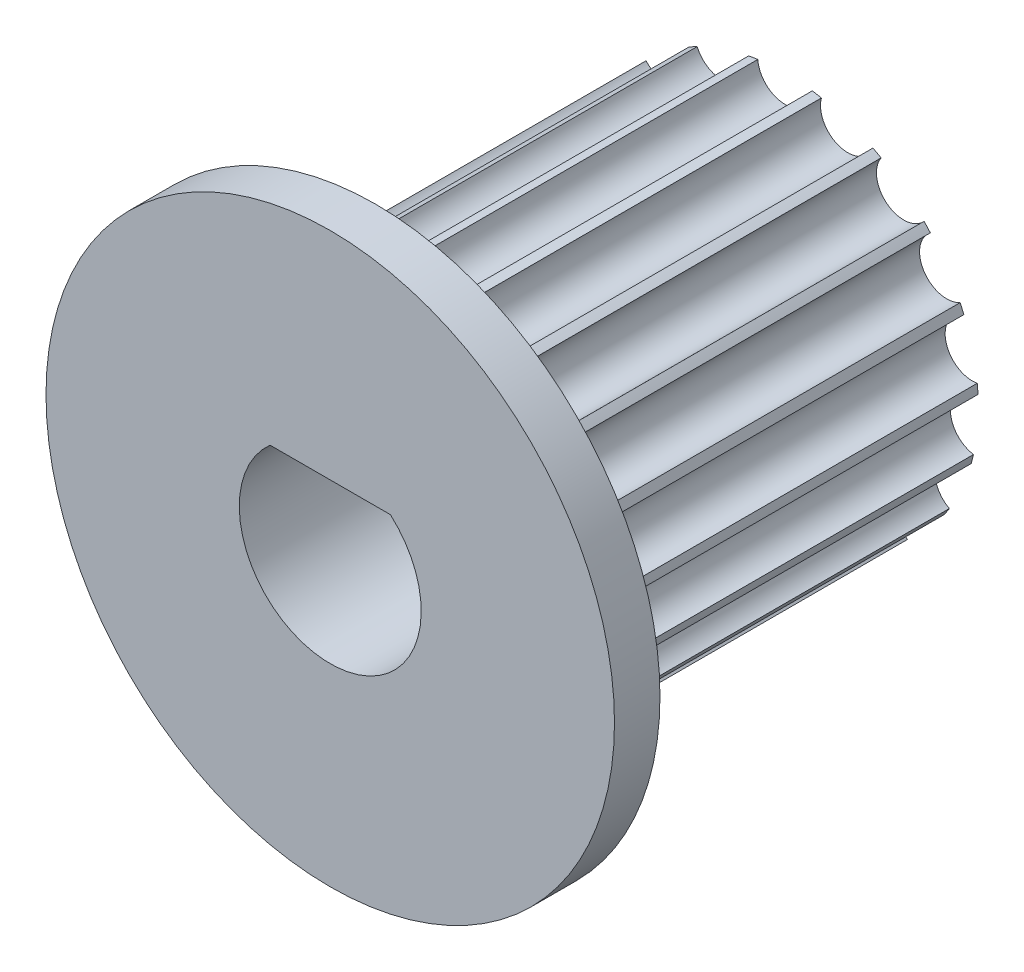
ISO-10303-21;
HEADER;
FILE_DESCRIPTION(('STEP AP214'),'2;1');
FILE_NAME('part.step','',(''),(''),'','','');
FILE_SCHEMA(('AUTOMOTIVE_DESIGN { 1 0 10303 214 1 1 1 1 }'));
ENDSEC;
DATA;
#1=APPLICATION_CONTEXT('core data for automotive mechanical design processes');
#2=APPLICATION_PROTOCOL_DEFINITION('international standard','automotive_design',2000,#1);
#3=PRODUCT_CONTEXT('',#1,'mechanical');
#4=PRODUCT('Part','Part','',(#3));
#5=PRODUCT_RELATED_PRODUCT_CATEGORY('part','',(#4));
#6=PRODUCT_DEFINITION_FORMATION('','',#4);
#7=PRODUCT_DEFINITION_CONTEXT('part definition',#1,'design');
#8=PRODUCT_DEFINITION('design','',#6,#7);
#9=PRODUCT_DEFINITION_SHAPE('','',#8);
#10=(LENGTH_UNIT() NAMED_UNIT(*) SI_UNIT(.MILLI.,.METRE.));
#11=(NAMED_UNIT(*) PLANE_ANGLE_UNIT() SI_UNIT($,.RADIAN.));
#12=(NAMED_UNIT(*) SI_UNIT($,.STERADIAN.) SOLID_ANGLE_UNIT());
#13=UNCERTAINTY_MEASURE_WITH_UNIT(LENGTH_MEASURE(1.E-05),#10,'distance_accuracy_value','');
#14=(GEOMETRIC_REPRESENTATION_CONTEXT(3) GLOBAL_UNCERTAINTY_ASSIGNED_CONTEXT((#13)) GLOBAL_UNIT_ASSIGNED_CONTEXT((#10,
#11,#12)) REPRESENTATION_CONTEXT('',''));
#15=CARTESIAN_POINT('',(0.,0.,0.));
#16=DIRECTION('',(0.,0.,1.));
#17=DIRECTION('',(1.,0.,0.));
#18=AXIS2_PLACEMENT_3D('',#15,#16,#17);
#19=CARTESIAN_POINT('',(0.,0.,0.));
#20=DIRECTION('',(0.,0.,-1.));
#21=DIRECTION('',(-1.,0.,0.));
#22=AXIS2_PLACEMENT_3D('',#19,#20,#21);
#23=PLANE('',#22);
#24=DIRECTION('',(1.,0.,0.));
#25=VECTOR('',#24,1.);
#26=CARTESIAN_POINT('',(2.64575131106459,3.,0.));
#27=LINE('',#26,#25);
#28=CARTESIAN_POINT('',(-2.64575131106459,3.,0.));
#29=VERTEX_POINT('',#28);
#30=CARTESIAN_POINT('',(2.64575131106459,3.,0.));
#31=VERTEX_POINT('',#30);
#32=EDGE_CURVE('E522',#29,#31,#27,.T.);
#33=ORIENTED_EDGE('',*,*,#32,.T.);
#34=CARTESIAN_POINT('',(0.,0.,0.));
#35=DIRECTION('',(0.,0.,-1.));
#36=DIRECTION('',(-1.,0.,0.));
#37=AXIS2_PLACEMENT_3D('',#34,#35,#36);
#38=CIRCLE('',#37,4.);
#39=EDGE_CURVE('E524',#31,#29,#38,.T.);
#40=ORIENTED_EDGE('',*,*,#39,.T.);
#41=EDGE_LOOP('',(#33,#40));
#42=FACE_BOUND('',#41,.T.);
#43=CARTESIAN_POINT('',(0.,0.,0.));
#44=DIRECTION('',(0.,0.,1.));
#45=DIRECTION('',(1.,0.,0.));
#46=AXIS2_PLACEMENT_3D('',#43,#44,#45);
#47=CIRCLE('',#46,12.5);
#48=CARTESIAN_POINT('',(12.5,0.,0.));
#49=VERTEX_POINT('',#48);
#50=EDGE_CURVE('E490',#49,#49,#47,.T.);
#51=ORIENTED_EDGE('',*,*,#50,.T.);
#52=EDGE_LOOP('',(#51));
#53=FACE_BOUND('',#52,.T.);
#54=ADVANCED_FACE('F31',(#42,#53),#23,.F.);
#55=CARTESIAN_POINT('',(0.,0.,28.6646892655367));
#56=DIRECTION('',(0.,0.,1.));
#57=DIRECTION('',(1.,0.,0.));
#58=AXIS2_PLACEMENT_3D('',#55,#56,#57);
#59=CYLINDRICAL_SURFACE('',#58,12.5);
#60=ORIENTED_EDGE('',*,*,#50,.F.);
#61=EDGE_LOOP('',(#60));
#62=FACE_BOUND('',#61,.T.);
#63=CARTESIAN_POINT('',(0.,0.,-2.));
#64=DIRECTION('',(0.,0.,1.));
#65=DIRECTION('',(1.,0.,0.));
#66=AXIS2_PLACEMENT_3D('',#63,#64,#65);
#67=CIRCLE('',#66,12.5);
#68=CARTESIAN_POINT('',(12.5,0.,-2.));
#69=VERTEX_POINT('',#68);
#70=EDGE_CURVE('E321',#69,#69,#67,.T.);
#71=ORIENTED_EDGE('',*,*,#70,.T.);
#72=EDGE_LOOP('',(#71));
#73=FACE_BOUND('',#72,.T.);
#74=ADVANCED_FACE('F496',(#62,#73),#59,.T.);
#75=CARTESIAN_POINT('',(0.,12.5,-2.));
#76=DIRECTION('',(0.,0.,1.));
#77=DIRECTION('',(1.,0.,0.));
#78=AXIS2_PLACEMENT_3D('',#75,#76,#77);
#79=PLANE('',#78);
#80=ORIENTED_EDGE('',*,*,#70,.F.);
#81=EDGE_LOOP('',(#80));
#82=FACE_BOUND('',#81,.T.);
#83=CARTESIAN_POINT('',(0.,0.,-2.));
#84=DIRECTION('',(0.,0.,1.));
#85=DIRECTION('',(1.,0.,0.));
#86=AXIS2_PLACEMENT_3D('',#83,#84,#85);
#87=CIRCLE('',#86,8.5);
#88=CARTESIAN_POINT('',(8.5,0.,-2.));
#89=VERTEX_POINT('',#88);
#90=EDGE_CURVE('E316',#89,#89,#87,.T.);
#91=ORIENTED_EDGE('',*,*,#90,.T.);
#92=EDGE_LOOP('',(#91));
#93=FACE_BOUND('',#92,.T.);
#94=ADVANCED_FACE('F498',(#82,#93),#79,.F.);
#95=CARTESIAN_POINT('',(0.,0.,28.6646892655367));
#96=DIRECTION('',(0.,0.,1.));
#97=DIRECTION('',(1.,0.,0.));
#98=AXIS2_PLACEMENT_3D('',#95,#96,#97);
#99=CYLINDRICAL_SURFACE('',#98,8.5);
#100=ORIENTED_EDGE('',*,*,#90,.F.);
#101=EDGE_LOOP('',(#100));
#102=FACE_BOUND('',#101,.T.);
#103=CARTESIAN_POINT('',(0.,0.,-3.));
#104=DIRECTION('',(0.,0.,-1.));
#105=DIRECTION('',(-1.,0.,0.));
#106=AXIS2_PLACEMENT_3D('',#103,#104,#105);
#107=CIRCLE('',#106,8.5);
#108=CARTESIAN_POINT('',(1.60029200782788,8.34799769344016,-3.));
#109=VERTEX_POINT('',#108);
#110=CARTESIAN_POINT('',(3.86459105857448,7.57066284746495,-3.));
#111=VERTEX_POINT('',#110);
#112=EDGE_CURVE('E11',#109,#111,#107,.T.);
#113=ORIENTED_EDGE('',*,*,#112,.F.);
#114=DIRECTION('',(0.,0.,-1.));
#115=VECTOR('',#114,1.);
#116=CARTESIAN_POINT('',(1.60029200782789,8.34799769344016,-11.5));
#117=LINE('',#116,#115);
#118=CARTESIAN_POINT('',(1.60029200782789,8.34799769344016,-20.));
#119=VERTEX_POINT('',#118);
#120=EDGE_CURVE('E287',#109,#119,#117,.T.);
#121=ORIENTED_EDGE('',*,*,#120,.T.);
#122=CARTESIAN_POINT('',(0.,0.,-20.));
#123=DIRECTION('',(0.,0.,1.));
#124=DIRECTION('',(1.,0.,0.));
#125=AXIS2_PLACEMENT_3D('',#122,#123,#124);
#126=CIRCLE('',#125,8.5);
#127=CARTESIAN_POINT('',(1.19700664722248,8.41529411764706,-20.));
#128=VERTEX_POINT('',#127);
#129=EDGE_CURVE('E298',#119,#128,#126,.T.);
#130=ORIENTED_EDGE('',*,*,#129,.T.);
#131=DIRECTION('',(0.,0.,-1.));
#132=VECTOR('',#131,1.);
#133=CARTESIAN_POINT('',(1.19700664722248,8.41529411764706,-11.5));
#134=LINE('',#133,#132);
#135=CARTESIAN_POINT('',(1.19700664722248,8.41529411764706,-3.));
#136=VERTEX_POINT('',#135);
#137=EDGE_CURVE('E821',#128,#136,#134,.F.);
#138=ORIENTED_EDGE('',*,*,#137,.T.);
#139=CARTESIAN_POINT('',(0.,0.,-3.));
#140=DIRECTION('',(0.,0.,-1.));
#141=DIRECTION('',(-1.,0.,0.));
#142=AXIS2_PLACEMENT_3D('',#139,#140,#141);
#143=CIRCLE('',#142,8.5);
#144=CARTESIAN_POINT('',(-1.19700664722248,8.41529411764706,-3.));
#145=VERTEX_POINT('',#144);
#146=EDGE_CURVE('E487',#145,#136,#143,.T.);
#147=ORIENTED_EDGE('',*,*,#146,.F.);
#148=DIRECTION('',(0.,0.,-1.));
#149=VECTOR('',#148,1.);
#150=CARTESIAN_POINT('',(-1.19700664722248,8.41529411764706,-11.5));
#151=LINE('',#150,#149);
#152=CARTESIAN_POINT('',(-1.19700664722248,8.41529411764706,-20.));
#153=VERTEX_POINT('',#152);
#154=EDGE_CURVE('E535',#145,#153,#151,.T.);
#155=ORIENTED_EDGE('',*,*,#154,.T.);
#156=CARTESIAN_POINT('',(-1.60029200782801,8.34799769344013,-20.));
#157=VERTEX_POINT('',#156);
#158=EDGE_CURVE('E309',#153,#157,#126,.T.);
#159=ORIENTED_EDGE('',*,*,#158,.T.);
#160=DIRECTION('',(0.,0.,-1.));
#161=VECTOR('',#160,1.);
#162=CARTESIAN_POINT('',(-1.60029200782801,8.34799769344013,-11.5));
#163=LINE('',#162,#161);
#164=CARTESIAN_POINT('',(-1.60029200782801,8.34799769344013,-3.));
#165=VERTEX_POINT('',#164);
#166=EDGE_CURVE('E814',#157,#165,#163,.F.);
#167=ORIENTED_EDGE('',*,*,#166,.T.);
#168=CARTESIAN_POINT('',(0.,0.,-3.));
#169=DIRECTION('',(0.,0.,-1.));
#170=DIRECTION('',(-1.,0.,0.));
#171=AXIS2_PLACEMENT_3D('',#168,#169,#170);
#172=CIRCLE('',#171,8.5);
#173=CARTESIAN_POINT('',(-3.86459105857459,7.5706628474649,-3.));
#174=VERTEX_POINT('',#173);
#175=EDGE_CURVE('E482',#174,#165,#172,.T.);
#176=ORIENTED_EDGE('',*,*,#175,.F.);
#177=DIRECTION('',(0.,0.,-1.));
#178=VECTOR('',#177,1.);
#179=CARTESIAN_POINT('',(-3.8645910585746,7.5706628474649,-11.5));
#180=LINE('',#179,#178);
#181=CARTESIAN_POINT('',(-3.8645910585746,7.5706628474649,-20.));
#182=VERTEX_POINT('',#181);
#183=EDGE_CURVE('E816',#174,#182,#180,.T.);
#184=ORIENTED_EDGE('',*,*,#183,.T.);
#185=CARTESIAN_POINT('',(-4.2241741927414,7.37606618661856,-20.));
#186=VERTEX_POINT('',#185);
#187=EDGE_CURVE('E317',#182,#186,#126,.T.);
#188=ORIENTED_EDGE('',*,*,#187,.T.);
#189=DIRECTION('',(0.,0.,-1.));
#190=VECTOR('',#189,1.);
#191=CARTESIAN_POINT('',(-4.2241741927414,7.37606618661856,-11.5));
#192=LINE('',#191,#190);
#193=CARTESIAN_POINT('',(-4.2241741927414,7.37606618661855,-3.));
#194=VERTEX_POINT('',#193);
#195=EDGE_CURVE('E807',#186,#194,#192,.F.);
#196=ORIENTED_EDGE('',*,*,#195,.T.);
#197=CARTESIAN_POINT('',(0.,0.,-3.));
#198=DIRECTION('',(0.,0.,-1.));
#199=DIRECTION('',(-1.,0.,0.));
#200=AXIS2_PLACEMENT_3D('',#197,#198,#199);
#201=CIRCLE('',#200,8.5);
#202=CARTESIAN_POINT('',(-6.11338706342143,5.90563278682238,-3.));
#203=VERTEX_POINT('',#202);
#204=EDGE_CURVE('E477',#203,#194,#201,.T.);
#205=ORIENTED_EDGE('',*,*,#204,.F.);
#206=DIRECTION('',(0.,0.,-1.));
#207=VECTOR('',#206,1.);
#208=CARTESIAN_POINT('',(-6.11338706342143,5.90563278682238,-11.5));
#209=LINE('',#208,#207);
#210=CARTESIAN_POINT('',(-6.11338706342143,5.90563278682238,-20.));
#211=VERTEX_POINT('',#210);
#212=EDGE_CURVE('E809',#203,#211,#209,.T.);
#213=ORIENTED_EDGE('',*,*,#212,.T.);
#214=CARTESIAN_POINT('',(-6.39030155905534,5.60482345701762,-20.));
#215=VERTEX_POINT('',#214);
#216=EDGE_CURVE('E323',#211,#215,#126,.T.);
#217=ORIENTED_EDGE('',*,*,#216,.T.);
#218=DIRECTION('',(0.,0.,-1.));
#219=VECTOR('',#218,1.);
#220=CARTESIAN_POINT('',(-6.39030155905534,5.60482345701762,-11.5));
#221=LINE('',#220,#219);
#222=CARTESIAN_POINT('',(-6.39030155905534,5.60482345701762,-3.));
#223=VERTEX_POINT('',#222);
#224=EDGE_CURVE('E800',#215,#223,#221,.F.);
#225=ORIENTED_EDGE('',*,*,#224,.T.);
#226=CARTESIAN_POINT('',(0.,0.,-3.));
#227=DIRECTION('',(0.,0.,-1.));
#228=DIRECTION('',(-1.,0.,0.));
#229=AXIS2_PLACEMENT_3D('',#226,#227,#228);
#230=CIRCLE('',#229,8.5);
#231=CARTESIAN_POINT('',(-7.69970272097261,3.60063577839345,-3.));
#232=VERTEX_POINT('',#231);
#233=EDGE_CURVE('E472',#232,#223,#230,.T.);
#234=ORIENTED_EDGE('',*,*,#233,.F.);
#235=DIRECTION('',(0.,0.,-1.));
#236=VECTOR('',#235,1.);
#237=CARTESIAN_POINT('',(-7.69970272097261,3.60063577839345,-11.5));
#238=LINE('',#237,#236);
#239=CARTESIAN_POINT('',(-7.69970272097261,3.60063577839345,-20.));
#240=VERTEX_POINT('',#239);
#241=EDGE_CURVE('E802',#232,#240,#238,.T.);
#242=ORIENTED_EDGE('',*,*,#241,.T.);
#243=CARTESIAN_POINT('',(-7.86394059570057,3.22621113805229,-20.));
#244=VERTEX_POINT('',#243);
#245=EDGE_CURVE('E328',#240,#244,#126,.T.);
#246=ORIENTED_EDGE('',*,*,#245,.T.);
#247=DIRECTION('',(0.,0.,-1.));
#248=VECTOR('',#247,1.);
#249=CARTESIAN_POINT('',(-7.86394059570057,3.22621113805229,-11.5));
#250=LINE('',#249,#248);
#251=CARTESIAN_POINT('',(-7.86394059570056,3.22621113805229,-3.));
#252=VERTEX_POINT('',#251);
#253=EDGE_CURVE('E793',#244,#252,#250,.F.);
#254=ORIENTED_EDGE('',*,*,#253,.T.);
#255=CARTESIAN_POINT('',(0.,0.,-3.));
#256=DIRECTION('',(0.,0.,-1.));
#257=DIRECTION('',(-1.,0.,0.));
#258=AXIS2_PLACEMENT_3D('',#255,#256,#257);
#259=CIRCLE('',#258,8.5);
#260=CARTESIAN_POINT('',(-8.45163611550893,0.905454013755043,-3.));
#261=VERTEX_POINT('',#260);
#262=EDGE_CURVE('E467',#261,#252,#259,.T.);
#263=ORIENTED_EDGE('',*,*,#262,.F.);
#264=DIRECTION('',(0.,0.,-1.));
#265=VECTOR('',#264,1.);
#266=CARTESIAN_POINT('',(-8.45163611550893,0.905454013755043,-11.5));
#267=LINE('',#266,#265);
#268=CARTESIAN_POINT('',(-8.45163611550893,0.905454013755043,-20.));
#269=VERTEX_POINT('',#268);
#270=EDGE_CURVE('E795',#261,#269,#267,.T.);
#271=ORIENTED_EDGE('',*,*,#270,.T.);
#272=CARTESIAN_POINT('',(-8.48539964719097,0.497988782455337,-20.));
#273=VERTEX_POINT('',#272);
#274=EDGE_CURVE('E333',#269,#273,#126,.T.);
#275=ORIENTED_EDGE('',*,*,#274,.T.);
#276=DIRECTION('',(0.,0.,-1.));
#277=VECTOR('',#276,1.);
#278=CARTESIAN_POINT('',(-8.48539964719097,0.497988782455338,-11.5));
#279=LINE('',#278,#277);
#280=CARTESIAN_POINT('',(-8.48539964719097,0.497988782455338,-3.));
#281=VERTEX_POINT('',#280);
#282=EDGE_CURVE('E786',#273,#281,#279,.F.);
#283=ORIENTED_EDGE('',*,*,#282,.T.);
#284=CARTESIAN_POINT('',(0.,0.,-3.));
#285=DIRECTION('',(0.,0.,-1.));
#286=DIRECTION('',(-1.,0.,0.));
#287=AXIS2_PLACEMENT_3D('',#284,#285,#286);
#288=CIRCLE('',#287,8.5);
#289=CARTESIAN_POINT('',(-8.28770359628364,-1.88784774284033,-3.));
#290=VERTEX_POINT('',#289);
#291=EDGE_CURVE('E462',#290,#281,#288,.T.);
#292=ORIENTED_EDGE('',*,*,#291,.F.);
#293=DIRECTION('',(0.,0.,-1.));
#294=VECTOR('',#293,1.);
#295=CARTESIAN_POINT('',(-8.28770359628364,-1.88784774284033,-11.5));
#296=LINE('',#295,#294);
#297=CARTESIAN_POINT('',(-8.28770359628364,-1.88784774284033,-20.));
#298=VERTEX_POINT('',#297);
#299=EDGE_CURVE('E788',#290,#298,#296,.T.);
#300=ORIENTED_EDGE('',*,*,#299,.T.);
#301=CARTESIAN_POINT('',(-8.18733398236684,-2.28419838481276,-20.));
#302=VERTEX_POINT('',#301);
#303=EDGE_CURVE('E338',#298,#302,#126,.T.);
#304=ORIENTED_EDGE('',*,*,#303,.T.);
#305=DIRECTION('',(0.,0.,-1.));
#306=VECTOR('',#305,1.);
#307=CARTESIAN_POINT('',(-8.18733398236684,-2.28419838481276,-11.5));
#308=LINE('',#307,#306);
#309=CARTESIAN_POINT('',(-8.18733398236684,-2.28419838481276,-3.));
#310=VERTEX_POINT('',#309);
#311=EDGE_CURVE('E779',#302,#310,#308,.F.);
#312=ORIENTED_EDGE('',*,*,#311,.T.);
#313=CARTESIAN_POINT('',(0.,0.,-3.));
#314=DIRECTION('',(0.,0.,-1.));
#315=DIRECTION('',(-1.,0.,0.));
#316=AXIS2_PLACEMENT_3D('',#313,#314,#315);
#317=CIRCLE('',#316,8.5);
#318=CARTESIAN_POINT('',(-7.2256697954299,-4.47657190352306,-3.));
#319=VERTEX_POINT('',#318);
#320=EDGE_CURVE('E457',#319,#310,#317,.T.);
#321=ORIENTED_EDGE('',*,*,#320,.F.);
#322=DIRECTION('',(0.,0.,-1.));
#323=VECTOR('',#322,1.);
#324=CARTESIAN_POINT('',(-7.2256697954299,-4.47657190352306,-11.5));
#325=LINE('',#324,#323);
#326=CARTESIAN_POINT('',(-7.2256697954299,-4.47657190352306,-20.));
#327=VERTEX_POINT('',#326);
#328=EDGE_CURVE('E781',#319,#327,#325,.T.);
#329=ORIENTED_EDGE('',*,*,#328,.T.);
#330=CARTESIAN_POINT('',(-7.00204364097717,-4.81885721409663,-20.));
#331=VERTEX_POINT('',#330);
#332=EDGE_CURVE('E343',#327,#331,#126,.T.);
#333=ORIENTED_EDGE('',*,*,#332,.T.);
#334=DIRECTION('',(0.,0.,-1.));
#335=VECTOR('',#334,1.);
#336=CARTESIAN_POINT('',(-7.00204364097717,-4.81885721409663,-11.5));
#337=LINE('',#336,#335);
#338=CARTESIAN_POINT('',(-7.00204364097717,-4.81885721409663,-3.));
#339=VERTEX_POINT('',#338);
#340=EDGE_CURVE('E772',#331,#339,#337,.F.);
#341=ORIENTED_EDGE('',*,*,#340,.T.);
#342=CARTESIAN_POINT('',(0.,0.,-3.));
#343=DIRECTION('',(0.,0.,-1.));
#344=DIRECTION('',(-1.,0.,0.));
#345=AXIS2_PLACEMENT_3D('',#342,#343,#344);
#346=CIRCLE('',#345,8.5);
#347=CARTESIAN_POINT('',(-5.38062255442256,-6.58019003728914,-3.));
#348=VERTEX_POINT('',#347);
#349=EDGE_CURVE('E452',#348,#339,#346,.T.);
#350=ORIENTED_EDGE('',*,*,#349,.F.);
#351=DIRECTION('',(0.,0.,-1.));
#352=VECTOR('',#351,1.);
#353=CARTESIAN_POINT('',(-5.38062255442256,-6.58019003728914,-11.5));
#354=LINE('',#353,#352);
#355=CARTESIAN_POINT('',(-5.38062255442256,-6.58019003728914,-20.));
#356=VERTEX_POINT('',#355);
#357=EDGE_CURVE('E774',#348,#356,#354,.T.);
#358=ORIENTED_EDGE('',*,*,#357,.T.);
#359=CARTESIAN_POINT('',(-5.05797322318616,-6.8313180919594,-20.));
#360=VERTEX_POINT('',#359);
#361=EDGE_CURVE('E348',#356,#360,#126,.T.);
#362=ORIENTED_EDGE('',*,*,#361,.T.);
#363=DIRECTION('',(0.,0.,-1.));
#364=VECTOR('',#363,1.);
#365=CARTESIAN_POINT('',(-5.05797322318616,-6.8313180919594,-11.5));
#366=LINE('',#365,#364);
#367=CARTESIAN_POINT('',(-5.05797322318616,-6.8313180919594,-3.));
#368=VERTEX_POINT('',#367);
#369=EDGE_CURVE('E765',#360,#368,#366,.F.);
#370=ORIENTED_EDGE('',*,*,#369,.T.);
#371=CARTESIAN_POINT('',(0.,0.,-3.));
#372=DIRECTION('',(0.,0.,-1.));
#373=DIRECTION('',(-1.,0.,0.));
#374=AXIS2_PLACEMENT_3D('',#371,#372,#373);
#375=CIRCLE('',#374,8.5);
#376=CARTESIAN_POINT('',(-2.95250137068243,-7.97074247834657,-3.));
#377=VERTEX_POINT('',#376);
#378=EDGE_CURVE('E447',#377,#368,#375,.T.);
#379=ORIENTED_EDGE('',*,*,#378,.F.);
#380=DIRECTION('',(0.,0.,-1.));
#381=VECTOR('',#380,1.);
#382=CARTESIAN_POINT('',(-2.95250137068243,-7.97074247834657,-11.5));
#383=LINE('',#382,#381);
#384=CARTESIAN_POINT('',(-2.95250137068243,-7.97074247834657,-20.));
#385=VERTEX_POINT('',#384);
#386=EDGE_CURVE('E767',#377,#385,#383,.T.);
#387=ORIENTED_EDGE('',*,*,#386,.T.);
#388=CARTESIAN_POINT('',(-2.56579292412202,-8.10349965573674,-20.));
#389=VERTEX_POINT('',#388);
#390=EDGE_CURVE('E353',#385,#389,#126,.T.);
#391=ORIENTED_EDGE('',*,*,#390,.T.);
#392=DIRECTION('',(0.,0.,-1.));
#393=VECTOR('',#392,1.);
#394=CARTESIAN_POINT('',(-2.56579292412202,-8.10349965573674,-11.5));
#395=LINE('',#394,#393);
#396=CARTESIAN_POINT('',(-2.56579292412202,-8.10349965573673,-3.));
#397=VERTEX_POINT('',#396);
#398=EDGE_CURVE('E758',#389,#397,#395,.F.);
#399=ORIENTED_EDGE('',*,*,#398,.T.);
#400=CARTESIAN_POINT('',(0.,0.,-3.));
#401=DIRECTION('',(0.,0.,-1.));
#402=DIRECTION('',(-1.,0.,0.));
#403=AXIS2_PLACEMENT_3D('',#400,#401,#402);
#404=CIRCLE('',#403,8.5);
#405=CARTESIAN_POINT('',(-0.204430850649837,-8.49754129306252,-3.));
#406=VERTEX_POINT('',#405);
#407=EDGE_CURVE('E442',#406,#397,#404,.T.);
#408=ORIENTED_EDGE('',*,*,#407,.F.);
#409=DIRECTION('',(0.,0.,-1.));
#410=VECTOR('',#409,1.);
#411=CARTESIAN_POINT('',(-0.204430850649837,-8.49754129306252,-11.5));
#412=LINE('',#411,#410);
#413=CARTESIAN_POINT('',(-0.204430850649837,-8.49754129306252,-20.));
#414=VERTEX_POINT('',#413);
#415=EDGE_CURVE('E760',#406,#414,#412,.T.);
#416=ORIENTED_EDGE('',*,*,#415,.T.);
#417=CARTESIAN_POINT('',(0.204430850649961,-8.49754129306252,-20.));
#418=VERTEX_POINT('',#417);
#419=EDGE_CURVE('E358',#414,#418,#126,.T.);
#420=ORIENTED_EDGE('',*,*,#419,.T.);
#421=DIRECTION('',(0.,0.,-1.));
#422=VECTOR('',#421,1.);
#423=CARTESIAN_POINT('',(0.20443085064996,-8.49754129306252,-11.5));
#424=LINE('',#423,#422);
#425=CARTESIAN_POINT('',(0.20443085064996,-8.49754129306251,-3.));
#426=VERTEX_POINT('',#425);
#427=EDGE_CURVE('E751',#418,#426,#424,.F.);
#428=ORIENTED_EDGE('',*,*,#427,.T.);
#429=CARTESIAN_POINT('',(0.,0.,-3.));
#430=DIRECTION('',(0.,0.,-1.));
#431=DIRECTION('',(-1.,0.,0.));
#432=AXIS2_PLACEMENT_3D('',#429,#430,#431);
#433=CIRCLE('',#432,8.5);
#434=CARTESIAN_POINT('',(2.56579292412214,-8.1034996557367,-3.));
#435=VERTEX_POINT('',#434);
#436=EDGE_CURVE('E437',#435,#426,#433,.T.);
#437=ORIENTED_EDGE('',*,*,#436,.F.);
#438=DIRECTION('',(0.,0.,-1.));
#439=VECTOR('',#438,1.);
#440=CARTESIAN_POINT('',(2.56579292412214,-8.1034996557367,-11.5));
#441=LINE('',#440,#439);
#442=CARTESIAN_POINT('',(2.56579292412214,-8.1034996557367,-20.));
#443=VERTEX_POINT('',#442);
#444=EDGE_CURVE('E753',#435,#443,#441,.T.);
#445=ORIENTED_EDGE('',*,*,#444,.T.);
#446=CARTESIAN_POINT('',(2.95250137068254,-7.97074247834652,-20.));
#447=VERTEX_POINT('',#446);
#448=EDGE_CURVE('E363',#443,#447,#126,.T.);
#449=ORIENTED_EDGE('',*,*,#448,.T.);
#450=DIRECTION('',(0.,0.,-1.));
#451=VECTOR('',#450,1.);
#452=CARTESIAN_POINT('',(2.95250137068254,-7.97074247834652,-11.5));
#453=LINE('',#452,#451);
#454=CARTESIAN_POINT('',(2.95250137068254,-7.97074247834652,-3.));
#455=VERTEX_POINT('',#454);
#456=EDGE_CURVE('E744',#447,#455,#453,.F.);
#457=ORIENTED_EDGE('',*,*,#456,.T.);
#458=CARTESIAN_POINT('',(0.,0.,-3.));
#459=DIRECTION('',(0.,0.,-1.));
#460=DIRECTION('',(-1.,0.,0.));
#461=AXIS2_PLACEMENT_3D('',#458,#459,#460);
#462=CIRCLE('',#461,8.5);
#463=CARTESIAN_POINT('',(5.05797322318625,-6.83131809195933,-3.));
#464=VERTEX_POINT('',#463);
#465=EDGE_CURVE('E432',#464,#455,#462,.T.);
#466=ORIENTED_EDGE('',*,*,#465,.F.);
#467=DIRECTION('',(0.,0.,-1.));
#468=VECTOR('',#467,1.);
#469=CARTESIAN_POINT('',(5.05797322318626,-6.83131809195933,-11.5));
#470=LINE('',#469,#468);
#471=CARTESIAN_POINT('',(5.05797322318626,-6.83131809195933,-20.));
#472=VERTEX_POINT('',#471);
#473=EDGE_CURVE('E746',#464,#472,#470,.T.);
#474=ORIENTED_EDGE('',*,*,#473,.T.);
#475=CARTESIAN_POINT('',(5.38062255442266,-6.58019003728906,-20.));
#476=VERTEX_POINT('',#475);
#477=EDGE_CURVE('E368',#472,#476,#126,.T.);
#478=ORIENTED_EDGE('',*,*,#477,.T.);
#479=DIRECTION('',(0.,0.,-1.));
#480=VECTOR('',#479,1.);
#481=CARTESIAN_POINT('',(5.38062255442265,-6.58019003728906,-11.5));
#482=LINE('',#481,#480);
#483=CARTESIAN_POINT('',(5.38062255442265,-6.58019003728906,-3.));
#484=VERTEX_POINT('',#483);
#485=EDGE_CURVE('E737',#476,#484,#482,.F.);
#486=ORIENTED_EDGE('',*,*,#485,.T.);
#487=CARTESIAN_POINT('',(0.,0.,-3.));
#488=DIRECTION('',(0.,0.,-1.));
#489=DIRECTION('',(-1.,0.,0.));
#490=AXIS2_PLACEMENT_3D('',#487,#488,#489);
#491=CIRCLE('',#490,8.5);
#492=CARTESIAN_POINT('',(7.00204364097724,-4.81885721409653,-3.));
#493=VERTEX_POINT('',#492);
#494=EDGE_CURVE('E427',#493,#484,#491,.T.);
#495=ORIENTED_EDGE('',*,*,#494,.F.);
#496=DIRECTION('',(0.,0.,-1.));
#497=VECTOR('',#496,1.);
#498=CARTESIAN_POINT('',(7.00204364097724,-4.81885721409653,-11.5));
#499=LINE('',#498,#497);
#500=CARTESIAN_POINT('',(7.00204364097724,-4.81885721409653,-20.));
#501=VERTEX_POINT('',#500);
#502=EDGE_CURVE('E739',#493,#501,#499,.T.);
#503=ORIENTED_EDGE('',*,*,#502,.T.);
#504=CARTESIAN_POINT('',(7.22566979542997,-4.47657190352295,-20.));
#505=VERTEX_POINT('',#504);
#506=EDGE_CURVE('E373',#501,#505,#126,.T.);
#507=ORIENTED_EDGE('',*,*,#506,.T.);
#508=DIRECTION('',(0.,0.,-1.));
#509=VECTOR('',#508,1.);
#510=CARTESIAN_POINT('',(7.22566979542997,-4.47657190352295,-11.5));
#511=LINE('',#510,#509);
#512=CARTESIAN_POINT('',(7.22566979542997,-4.47657190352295,-3.));
#513=VERTEX_POINT('',#512);
#514=EDGE_CURVE('E730',#505,#513,#511,.F.);
#515=ORIENTED_EDGE('',*,*,#514,.T.);
#516=CARTESIAN_POINT('',(0.,0.,-3.));
#517=DIRECTION('',(0.,0.,-1.));
#518=DIRECTION('',(-1.,0.,0.));
#519=AXIS2_PLACEMENT_3D('',#516,#517,#518);
#520=CIRCLE('',#519,8.5);
#521=CARTESIAN_POINT('',(8.18733398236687,-2.28419838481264,-3.));
#522=VERTEX_POINT('',#521);
#523=EDGE_CURVE('E422',#522,#513,#520,.T.);
#524=ORIENTED_EDGE('',*,*,#523,.F.);
#525=DIRECTION('',(0.,0.,-1.));
#526=VECTOR('',#525,1.);
#527=CARTESIAN_POINT('',(8.18733398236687,-2.28419838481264,-11.5));
#528=LINE('',#527,#526);
#529=CARTESIAN_POINT('',(8.18733398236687,-2.28419838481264,-20.));
#530=VERTEX_POINT('',#529);
#531=EDGE_CURVE('E732',#522,#530,#528,.T.);
#532=ORIENTED_EDGE('',*,*,#531,.T.);
#533=CARTESIAN_POINT('',(8.28770359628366,-1.88784774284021,-20.));
#534=VERTEX_POINT('',#533);
#535=EDGE_CURVE('E378',#530,#534,#126,.T.);
#536=ORIENTED_EDGE('',*,*,#535,.T.);
#537=DIRECTION('',(0.,0.,-1.));
#538=VECTOR('',#537,1.);
#539=CARTESIAN_POINT('',(8.28770359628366,-1.88784774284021,-11.5));
#540=LINE('',#539,#538);
#541=CARTESIAN_POINT('',(8.28770359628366,-1.88784774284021,-3.));
#542=VERTEX_POINT('',#541);
#543=EDGE_CURVE('E723',#534,#542,#540,.F.);
#544=ORIENTED_EDGE('',*,*,#543,.T.);
#545=CARTESIAN_POINT('',(0.,0.,-3.));
#546=DIRECTION('',(0.,0.,-1.));
#547=DIRECTION('',(-1.,0.,0.));
#548=AXIS2_PLACEMENT_3D('',#545,#546,#547);
#549=CIRCLE('',#548,8.5);
#550=CARTESIAN_POINT('',(8.48539964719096,0.497988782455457,-3.));
#551=VERTEX_POINT('',#550);
#552=EDGE_CURVE('E417',#551,#542,#549,.T.);
#553=ORIENTED_EDGE('',*,*,#552,.F.);
#554=DIRECTION('',(0.,0.,-1.));
#555=VECTOR('',#554,1.);
#556=CARTESIAN_POINT('',(8.48539964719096,0.497988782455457,-11.5));
#557=LINE('',#556,#555);
#558=CARTESIAN_POINT('',(8.48539964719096,0.497988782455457,-20.));
#559=VERTEX_POINT('',#558);
#560=EDGE_CURVE('E725',#551,#559,#557,.T.);
#561=ORIENTED_EDGE('',*,*,#560,.T.);
#562=CARTESIAN_POINT('',(8.45163611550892,0.905454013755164,-20.));
#563=VERTEX_POINT('',#562);
#564=EDGE_CURVE('E383',#559,#563,#126,.T.);
#565=ORIENTED_EDGE('',*,*,#564,.T.);
#566=DIRECTION('',(0.,0.,-1.));
#567=VECTOR('',#566,1.);
#568=CARTESIAN_POINT('',(8.45163611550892,0.905454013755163,-11.5));
#569=LINE('',#568,#567);
#570=CARTESIAN_POINT('',(8.45163611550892,0.905454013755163,-3.));
#571=VERTEX_POINT('',#570);
#572=EDGE_CURVE('E716',#563,#571,#569,.F.);
#573=ORIENTED_EDGE('',*,*,#572,.T.);
#574=CARTESIAN_POINT('',(0.,0.,-3.));
#575=DIRECTION('',(0.,0.,-1.));
#576=DIRECTION('',(-1.,0.,0.));
#577=AXIS2_PLACEMENT_3D('',#574,#575,#576);
#578=CIRCLE('',#577,8.5);
#579=CARTESIAN_POINT('',(7.86394059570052,3.2262111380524,-3.));
#580=VERTEX_POINT('',#579);
#581=EDGE_CURVE('E412',#580,#571,#578,.T.);
#582=ORIENTED_EDGE('',*,*,#581,.F.);
#583=DIRECTION('',(0.,0.,-1.));
#584=VECTOR('',#583,1.);
#585=CARTESIAN_POINT('',(7.86394059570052,3.2262111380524,-11.5));
#586=LINE('',#585,#584);
#587=CARTESIAN_POINT('',(7.86394059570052,3.2262111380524,-20.));
#588=VERTEX_POINT('',#587);
#589=EDGE_CURVE('E718',#580,#588,#586,.T.);
#590=ORIENTED_EDGE('',*,*,#589,.T.);
#591=CARTESIAN_POINT('',(7.69970272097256,3.60063577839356,-20.));
#592=VERTEX_POINT('',#591);
#593=EDGE_CURVE('E388',#588,#592,#126,.T.);
#594=ORIENTED_EDGE('',*,*,#593,.T.);
#595=DIRECTION('',(0.,0.,-1.));
#596=VECTOR('',#595,1.);
#597=CARTESIAN_POINT('',(7.69970272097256,3.60063577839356,-11.5));
#598=LINE('',#597,#596);
#599=CARTESIAN_POINT('',(7.69970272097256,3.60063577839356,-3.));
#600=VERTEX_POINT('',#599);
#601=EDGE_CURVE('E710',#592,#600,#598,.F.);
#602=ORIENTED_EDGE('',*,*,#601,.T.);
#603=CARTESIAN_POINT('',(0.,0.,-3.));
#604=DIRECTION('',(0.,0.,-1.));
#605=DIRECTION('',(-1.,0.,0.));
#606=AXIS2_PLACEMENT_3D('',#603,#604,#605);
#607=CIRCLE('',#606,8.5);
#608=CARTESIAN_POINT('',(6.39030155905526,5.60482345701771,-3.));
#609=VERTEX_POINT('',#608);
#610=EDGE_CURVE('E406',#609,#600,#607,.T.);
#611=ORIENTED_EDGE('',*,*,#610,.F.);
#612=DIRECTION('',(0.,0.,-1.));
#613=VECTOR('',#612,1.);
#614=CARTESIAN_POINT('',(6.39030155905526,5.60482345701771,-11.5));
#615=LINE('',#614,#613);
#616=CARTESIAN_POINT('',(6.39030155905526,5.60482345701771,-20.));
#617=VERTEX_POINT('',#616);
#618=EDGE_CURVE('E401',#609,#617,#615,.T.);
#619=ORIENTED_EDGE('',*,*,#618,.T.);
#620=CARTESIAN_POINT('',(6.11338706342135,5.90563278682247,-20.));
#621=VERTEX_POINT('',#620);
#622=EDGE_CURVE('E310',#617,#621,#126,.T.);
#623=ORIENTED_EDGE('',*,*,#622,.T.);
#624=DIRECTION('',(0.,0.,-1.));
#625=VECTOR('',#624,1.);
#626=CARTESIAN_POINT('',(6.11338706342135,5.90563278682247,-11.5));
#627=LINE('',#626,#625);
#628=CARTESIAN_POINT('',(6.11338706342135,5.90563278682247,-3.));
#629=VERTEX_POINT('',#628);
#630=EDGE_CURVE('E53',#621,#629,#627,.F.);
#631=ORIENTED_EDGE('',*,*,#630,.T.);
#632=CARTESIAN_POINT('',(0.,0.,-3.));
#633=DIRECTION('',(0.,0.,-1.));
#634=DIRECTION('',(-1.,0.,0.));
#635=AXIS2_PLACEMENT_3D('',#632,#633,#634);
#636=CIRCLE('',#635,8.5);
#637=CARTESIAN_POINT('',(4.22417419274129,7.37606618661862,-3.));
#638=VERTEX_POINT('',#637);
#639=EDGE_CURVE('E293',#638,#629,#636,.T.);
#640=ORIENTED_EDGE('',*,*,#639,.F.);
#641=DIRECTION('',(0.,0.,-1.));
#642=VECTOR('',#641,1.);
#643=CARTESIAN_POINT('',(4.22417419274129,7.37606618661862,-11.5));
#644=LINE('',#643,#642);
#645=CARTESIAN_POINT('',(4.22417419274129,7.37606618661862,-20.));
#646=VERTEX_POINT('',#645);
#647=EDGE_CURVE('E705',#638,#646,#644,.T.);
#648=ORIENTED_EDGE('',*,*,#647,.T.);
#649=CARTESIAN_POINT('',(3.86459105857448,7.57066284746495,-20.));
#650=VERTEX_POINT('',#649);
#651=EDGE_CURVE('E306',#646,#650,#126,.T.);
#652=ORIENTED_EDGE('',*,*,#651,.T.);
#653=DIRECTION('',(0.,0.,-1.));
#654=VECTOR('',#653,1.);
#655=CARTESIAN_POINT('',(3.86459105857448,7.57066284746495,-11.5));
#656=LINE('',#655,#654);
#657=EDGE_CURVE('E45',#650,#111,#656,.F.);
#658=ORIENTED_EDGE('',*,*,#657,.T.);
#659=EDGE_LOOP('',(#113,#121,#130,#138,#147,#155,#159,#167,#176,#184,#188,#196,#205,#213,#217,
#225,#234,#242,#246,#254,#263,#271,#275,#283,#292,#300,#304,#312,#321,#329,#333,#341,#350,#358,
#362,#370,#379,#387,#391,#399,#408,#416,#420,#428,#437,#445,#449,#457,#466,#474,#478,#486,#495,
#503,#507,#515,#524,#532,#536,#544,#553,#561,#565,#573,#582,#590,#594,#602,#611,#619,#623,#631,
#640,#648,#652,#658));
#660=FACE_BOUND('',#659,.T.);
#661=ADVANCED_FACE('F296',(#102,#660),#99,.T.);
#662=CARTESIAN_POINT('',(0.,8.5,-20.));
#663=DIRECTION('',(0.,0.,1.));
#664=DIRECTION('',(1.,0.,0.));
#665=AXIS2_PLACEMENT_3D('',#662,#663,#664);
#666=PLANE('',#665);
#667=DIRECTION('',(1.,0.,0.));
#668=VECTOR('',#667,1.);
#669=CARTESIAN_POINT('',(2.64575131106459,3.,-20.));
#670=LINE('',#669,#668);
#671=CARTESIAN_POINT('',(-2.64575131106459,3.,-20.));
#672=VERTEX_POINT('',#671);
#673=CARTESIAN_POINT('',(2.64575131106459,3.,-20.));
#674=VERTEX_POINT('',#673);
#675=EDGE_CURVE('E529',#672,#674,#670,.T.);
#676=ORIENTED_EDGE('',*,*,#675,.F.);
#677=CARTESIAN_POINT('',(0.,0.,-20.));
#678=DIRECTION('',(0.,0.,-1.));
#679=DIRECTION('',(-1.,0.,0.));
#680=AXIS2_PLACEMENT_3D('',#677,#678,#679);
#681=CIRCLE('',#680,4.);
#682=EDGE_CURVE('E533',#674,#672,#681,.T.);
#683=ORIENTED_EDGE('',*,*,#682,.F.);
#684=EDGE_LOOP('',(#676,#683));
#685=FACE_BOUND('',#684,.T.);
#686=ORIENTED_EDGE('',*,*,#129,.F.);
#687=CARTESIAN_POINT('',(2.7599454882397,8.03944655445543,-20.));
#688=DIRECTION('',(0.,0.,1.));
#689=DIRECTION('',(1.,0.,0.));
#690=AXIS2_PLACEMENT_3D('',#687,#688,#689);
#691=CIRCLE('',#690,1.2);
#692=EDGE_CURVE('E38',#119,#650,#691,.T.);
#693=ORIENTED_EDGE('',*,*,#692,.T.);
#694=ORIENTED_EDGE('',*,*,#651,.F.);
#695=CARTESIAN_POINT('',(5.22080805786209,6.70769432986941,-20.));
#696=DIRECTION('',(0.,0.,1.));
#697=DIRECTION('',(1.,0.,0.));
#698=AXIS2_PLACEMENT_3D('',#695,#696,#697);
#699=CIRCLE('',#698,1.2);
#700=EDGE_CURVE('E404',#646,#621,#699,.T.);
#701=ORIENTED_EDGE('',*,*,#700,.T.);
#702=ORIENTED_EDGE('',*,*,#622,.F.);
#703=CARTESIAN_POINT('',(7.11591506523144,4.64905934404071,-20.));
#704=DIRECTION('',(0.,0.,1.));
#705=DIRECTION('',(1.,0.,0.));
#706=AXIS2_PLACEMENT_3D('',#703,#704,#705);
#707=CIRCLE('',#706,1.2);
#708=EDGE_CURVE('E403',#617,#592,#707,.T.);
#709=ORIENTED_EDGE('',*,*,#708,.T.);
#710=ORIENTED_EDGE('',*,*,#593,.F.);
#711=CARTESIAN_POINT('',(8.23990226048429,2.08662664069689,-20.));
#712=DIRECTION('',(0.,0.,1.));
#713=DIRECTION('',(1.,0.,0.));
#714=AXIS2_PLACEMENT_3D('',#711,#712,#713);
#715=CIRCLE('',#714,1.2);
#716=EDGE_CURVE('E414',#588,#563,#715,.T.);
#717=ORIENTED_EDGE('',*,*,#716,.T.);
#718=ORIENTED_EDGE('',*,*,#564,.F.);
#719=CARTESIAN_POINT('',(8.4709681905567,-0.701924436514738,-20.));
#720=DIRECTION('',(0.,0.,1.));
#721=DIRECTION('',(1.,0.,0.));
#722=AXIS2_PLACEMENT_3D('',#719,#720,#721);
#723=CIRCLE('',#722,1.2);
#724=EDGE_CURVE('E419',#559,#534,#723,.T.);
#725=ORIENTED_EDGE('',*,*,#724,.T.);
#726=ORIENTED_EDGE('',*,*,#535,.F.);
#727=CARTESIAN_POINT('',(7.78407327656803,-3.41441110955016,-20.));
#728=DIRECTION('',(0.,0.,1.));
#729=DIRECTION('',(1.,0.,0.));
#730=AXIS2_PLACEMENT_3D('',#727,#728,#729);
#731=CIRCLE('',#730,1.2);
#732=EDGE_CURVE('E424',#530,#505,#731,.T.);
#733=ORIENTED_EDGE('',*,*,#732,.T.);
#734=ORIENTED_EDGE('',*,*,#506,.F.);
#735=CARTESIAN_POINT('',(6.25365324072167,-5.75689335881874,-20.));
#736=DIRECTION('',(0.,0.,1.));
#737=DIRECTION('',(1.,0.,0.));
#738=AXIS2_PLACEMENT_3D('',#735,#736,#737);
#739=CIRCLE('',#738,1.2);
#740=EDGE_CURVE('E429',#501,#476,#739,.T.);
#741=ORIENTED_EDGE('',*,*,#740,.T.);
#742=ORIENTED_EDGE('',*,*,#477,.F.);
#743=CARTESIAN_POINT('',(4.04555284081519,-7.47552688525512,-20.));
#744=DIRECTION('',(0.,0.,1.));
#745=DIRECTION('',(1.,0.,0.));
#746=AXIS2_PLACEMENT_3D('',#743,#744,#745);
#747=CIRCLE('',#746,1.2);
#748=EDGE_CURVE('E434',#472,#447,#747,.T.);
#749=ORIENTED_EDGE('',*,*,#748,.T.);
#750=ORIENTED_EDGE('',*,*,#448,.F.);
#751=CARTESIAN_POINT('',(1.3990540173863,-8.38407107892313,-20.));
#752=DIRECTION('',(0.,0.,1.));
#753=DIRECTION('',(1.,0.,0.));
#754=AXIS2_PLACEMENT_3D('',#751,#752,#753);
#755=CIRCLE('',#754,1.2);
#756=EDGE_CURVE('E439',#443,#418,#755,.T.);
#757=ORIENTED_EDGE('',*,*,#756,.T.);
#758=ORIENTED_EDGE('',*,*,#419,.F.);
#759=CARTESIAN_POINT('',(-1.39905401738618,-8.38407107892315,-20.));
#760=DIRECTION('',(0.,0.,1.));
#761=DIRECTION('',(1.,0.,0.));
#762=AXIS2_PLACEMENT_3D('',#759,#760,#761);
#763=CIRCLE('',#762,1.2);
#764=EDGE_CURVE('E444',#414,#389,#763,.T.);
#765=ORIENTED_EDGE('',*,*,#764,.T.);
#766=ORIENTED_EDGE('',*,*,#390,.F.);
#767=CARTESIAN_POINT('',(-4.04555284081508,-7.47552688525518,-20.));
#768=DIRECTION('',(0.,0.,1.));
#769=DIRECTION('',(1.,0.,0.));
#770=AXIS2_PLACEMENT_3D('',#767,#768,#769);
#771=CIRCLE('',#770,1.2);
#772=EDGE_CURVE('E449',#385,#360,#771,.T.);
#773=ORIENTED_EDGE('',*,*,#772,.T.);
#774=ORIENTED_EDGE('',*,*,#361,.F.);
#775=CARTESIAN_POINT('',(-6.25365324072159,-5.75689335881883,-20.));
#776=DIRECTION('',(0.,0.,1.));
#777=DIRECTION('',(1.,0.,0.));
#778=AXIS2_PLACEMENT_3D('',#775,#776,#777);
#779=CIRCLE('',#778,1.2);
#780=EDGE_CURVE('E454',#356,#331,#779,.T.);
#781=ORIENTED_EDGE('',*,*,#780,.T.);
#782=ORIENTED_EDGE('',*,*,#332,.F.);
#783=CARTESIAN_POINT('',(-7.78407327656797,-3.41441110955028,-20.));
#784=DIRECTION('',(0.,0.,1.));
#785=DIRECTION('',(1.,0.,0.));
#786=AXIS2_PLACEMENT_3D('',#783,#784,#785);
#787=CIRCLE('',#786,1.2);
#788=EDGE_CURVE('E459',#327,#302,#787,.T.);
#789=ORIENTED_EDGE('',*,*,#788,.T.);
#790=ORIENTED_EDGE('',*,*,#303,.F.);
#791=CARTESIAN_POINT('',(-8.47096819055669,-0.701924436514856,-20.));
#792=DIRECTION('',(0.,0.,1.));
#793=DIRECTION('',(1.,0.,0.));
#794=AXIS2_PLACEMENT_3D('',#791,#792,#793);
#795=CIRCLE('',#794,1.2);
#796=EDGE_CURVE('E464',#298,#273,#795,.T.);
#797=ORIENTED_EDGE('',*,*,#796,.T.);
#798=ORIENTED_EDGE('',*,*,#274,.F.);
#799=CARTESIAN_POINT('',(-8.23990226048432,2.08662664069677,-20.));
#800=DIRECTION('',(0.,0.,1.));
#801=DIRECTION('',(1.,0.,0.));
#802=AXIS2_PLACEMENT_3D('',#799,#800,#801);
#803=CIRCLE('',#802,1.2);
#804=EDGE_CURVE('E469',#269,#244,#803,.T.);
#805=ORIENTED_EDGE('',*,*,#804,.T.);
#806=ORIENTED_EDGE('',*,*,#245,.F.);
#807=CARTESIAN_POINT('',(-7.1159150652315,4.64905934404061,-20.));
#808=DIRECTION('',(0.,0.,1.));
#809=DIRECTION('',(1.,0.,0.));
#810=AXIS2_PLACEMENT_3D('',#807,#808,#809);
#811=CIRCLE('',#810,1.2);
#812=EDGE_CURVE('E474',#240,#215,#811,.T.);
#813=ORIENTED_EDGE('',*,*,#812,.T.);
#814=ORIENTED_EDGE('',*,*,#216,.F.);
#815=CARTESIAN_POINT('',(-5.22080805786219,6.70769432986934,-20.));
#816=DIRECTION('',(0.,0.,1.));
#817=DIRECTION('',(1.,0.,0.));
#818=AXIS2_PLACEMENT_3D('',#815,#816,#817);
#819=CIRCLE('',#818,1.2);
#820=EDGE_CURVE('E479',#211,#186,#819,.T.);
#821=ORIENTED_EDGE('',*,*,#820,.T.);
#822=ORIENTED_EDGE('',*,*,#187,.F.);
#823=CARTESIAN_POINT('',(-2.75994548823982,8.0394465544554,-20.));
#824=DIRECTION('',(0.,0.,1.));
#825=DIRECTION('',(1.,0.,0.));
#826=AXIS2_PLACEMENT_3D('',#823,#824,#825);
#827=CIRCLE('',#826,1.2);
#828=EDGE_CURVE('E484',#182,#157,#827,.T.);
#829=ORIENTED_EDGE('',*,*,#828,.T.);
#830=ORIENTED_EDGE('',*,*,#158,.F.);
#831=CARTESIAN_POINT('',(0.,8.5,-20.));
#832=DIRECTION('',(0.,0.,1.));
#833=DIRECTION('',(1.,0.,0.));
#834=AXIS2_PLACEMENT_3D('',#831,#832,#833);
#835=CIRCLE('',#834,1.2);
#836=EDGE_CURVE('E305',#153,#128,#835,.T.);
#837=ORIENTED_EDGE('',*,*,#836,.T.);
#838=EDGE_LOOP('',(#686,#693,#694,#701,#702,#709,#710,#717,#718,#725,#726,#733,#734,#741,#742,
#749,#750,#757,#758,#765,#766,#773,#774,#781,#782,#789,#790,#797,#798,#805,#806,#813,#814,#821,
#822,#829,#830,#837));
#839=FACE_BOUND('',#838,.T.);
#840=ADVANCED_FACE('F303',(#685,#839),#666,.F.);
#841=CARTESIAN_POINT('',(0.,0.,0.));
#842=DIRECTION('',(0.,0.,-1.));
#843=DIRECTION('',(-1.,0.,0.));
#844=AXIS2_PLACEMENT_3D('',#841,#842,#843);
#845=CYLINDRICAL_SURFACE('',#844,4.);
#846=ORIENTED_EDGE('',*,*,#682,.T.);
#847=DIRECTION('',(0.,0.,-1.));
#848=VECTOR('',#847,1.);
#849=CARTESIAN_POINT('',(-2.64575131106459,3.,0.));
#850=LINE('',#849,#848);
#851=EDGE_CURVE('E311',#29,#672,#850,.T.);
#852=ORIENTED_EDGE('',*,*,#851,.F.);
#853=ORIENTED_EDGE('',*,*,#39,.F.);
#854=DIRECTION('',(0.,0.,-1.));
#855=VECTOR('',#854,1.);
#856=CARTESIAN_POINT('',(2.64575131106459,3.,0.));
#857=LINE('',#856,#855);
#858=EDGE_CURVE('E307',#31,#674,#857,.T.);
#859=ORIENTED_EDGE('',*,*,#858,.T.);
#860=EDGE_LOOP('',(#846,#852,#853,#859));
#861=FACE_BOUND('',#860,.T.);
#862=ADVANCED_FACE('F509',(#861),#845,.F.);
#863=CARTESIAN_POINT('',(2.64575131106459,3.,0.));
#864=DIRECTION('',(0.,1.,0.));
#865=DIRECTION('',(0.,0.,1.));
#866=AXIS2_PLACEMENT_3D('',#863,#864,#865);
#867=PLANE('',#866);
#868=ORIENTED_EDGE('',*,*,#675,.T.);
#869=ORIENTED_EDGE('',*,*,#858,.F.);
#870=ORIENTED_EDGE('',*,*,#32,.F.);
#871=ORIENTED_EDGE('',*,*,#851,.T.);
#872=EDGE_LOOP('',(#868,#869,#870,#871));
#873=FACE_BOUND('',#872,.T.);
#874=ADVANCED_FACE('F539',(#873),#867,.F.);
#875=CARTESIAN_POINT('',(0.,8.5,-3.));
#876=DIRECTION('',(0.,0.,-1.));
#877=DIRECTION('',(-1.,0.,0.));
#878=AXIS2_PLACEMENT_3D('',#875,#876,#877);
#879=PLANE('',#878);
#880=ORIENTED_EDGE('',*,*,#146,.T.);
#881=CARTESIAN_POINT('',(0.,8.5,-3.));
#882=DIRECTION('',(0.,0.,-1.));
#883=DIRECTION('',(-1.,0.,0.));
#884=AXIS2_PLACEMENT_3D('',#881,#882,#883);
#885=CIRCLE('',#884,1.2);
#886=EDGE_CURVE('E818',#136,#145,#885,.T.);
#887=ORIENTED_EDGE('',*,*,#886,.T.);
#888=EDGE_LOOP('',(#880,#887));
#889=FACE_BOUND('',#888,.T.);
#890=ADVANCED_FACE('F546',(#889),#879,.T.);
#891=CARTESIAN_POINT('',(0.,8.5,-3.));
#892=DIRECTION('',(0.,0.,-1.));
#893=DIRECTION('',(-1.,0.,0.));
#894=AXIS2_PLACEMENT_3D('',#891,#892,#893);
#895=CYLINDRICAL_SURFACE('',#894,1.2);
#896=ORIENTED_EDGE('',*,*,#886,.F.);
#897=ORIENTED_EDGE('',*,*,#137,.F.);
#898=ORIENTED_EDGE('',*,*,#836,.F.);
#899=ORIENTED_EDGE('',*,*,#154,.F.);
#900=EDGE_LOOP('',(#896,#897,#898,#899));
#901=FACE_BOUND('',#900,.T.);
#902=ADVANCED_FACE('F549',(#901),#895,.F.);
#903=CARTESIAN_POINT('',(-2.75994548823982,8.0394465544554,-3.));
#904=DIRECTION('',(0.,0.,-1.));
#905=DIRECTION('',(-0.945817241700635,-0.324699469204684,0.));
#906=AXIS2_PLACEMENT_3D('',#903,#904,#905);
#907=PLANE('',#906);
#908=ORIENTED_EDGE('',*,*,#175,.T.);
#909=CARTESIAN_POINT('',(-2.75994548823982,8.0394465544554,-3.));
#910=DIRECTION('',(0.,0.,-1.));
#911=DIRECTION('',(-0.945817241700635,-0.324699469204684,0.));
#912=AXIS2_PLACEMENT_3D('',#909,#910,#911);
#913=CIRCLE('',#912,1.2);
#914=EDGE_CURVE('E811',#165,#174,#913,.T.);
#915=ORIENTED_EDGE('',*,*,#914,.T.);
#916=EDGE_LOOP('',(#908,#915));
#917=FACE_BOUND('',#916,.T.);
#918=ADVANCED_FACE('F552',(#917),#907,.T.);
#919=CARTESIAN_POINT('',(-2.75994548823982,8.0394465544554,-3.));
#920=DIRECTION('',(0.,0.,-1.));
#921=DIRECTION('',(-1.,0.,0.));
#922=AXIS2_PLACEMENT_3D('',#919,#920,#921);
#923=CYLINDRICAL_SURFACE('',#922,1.2);
#924=ORIENTED_EDGE('',*,*,#914,.F.);
#925=ORIENTED_EDGE('',*,*,#166,.F.);
#926=ORIENTED_EDGE('',*,*,#828,.F.);
#927=ORIENTED_EDGE('',*,*,#183,.F.);
#928=EDGE_LOOP('',(#924,#925,#926,#927));
#929=FACE_BOUND('',#928,.T.);
#930=ADVANCED_FACE('F557',(#929),#923,.F.);
#931=CARTESIAN_POINT('',(-5.22080805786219,6.70769432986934,-3.));
#932=DIRECTION('',(0.,0.,-1.));
#933=DIRECTION('',(-0.789140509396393,-0.614212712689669,0.));
#934=AXIS2_PLACEMENT_3D('',#931,#932,#933);
#935=PLANE('',#934);
#936=ORIENTED_EDGE('',*,*,#204,.T.);
#937=CARTESIAN_POINT('',(-5.22080805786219,6.70769432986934,-3.));
#938=DIRECTION('',(0.,0.,-1.));
#939=DIRECTION('',(-0.789140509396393,-0.614212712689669,0.));
#940=AXIS2_PLACEMENT_3D('',#937,#938,#939);
#941=CIRCLE('',#940,1.2);
#942=EDGE_CURVE('E804',#194,#203,#941,.T.);
#943=ORIENTED_EDGE('',*,*,#942,.T.);
#944=EDGE_LOOP('',(#936,#943));
#945=FACE_BOUND('',#944,.T.);
#946=ADVANCED_FACE('F560',(#945),#935,.T.);
#947=CARTESIAN_POINT('',(-5.22080805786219,6.70769432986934,-3.));
#948=DIRECTION('',(0.,0.,-1.));
#949=DIRECTION('',(-1.,0.,0.));
#950=AXIS2_PLACEMENT_3D('',#947,#948,#949);
#951=CYLINDRICAL_SURFACE('',#950,1.2);
#952=ORIENTED_EDGE('',*,*,#942,.F.);
#953=ORIENTED_EDGE('',*,*,#195,.F.);
#954=ORIENTED_EDGE('',*,*,#820,.F.);
#955=ORIENTED_EDGE('',*,*,#212,.F.);
#956=EDGE_LOOP('',(#952,#953,#954,#955));
#957=FACE_BOUND('',#956,.T.);
#958=ADVANCED_FACE('F565',(#957),#951,.F.);
#959=CARTESIAN_POINT('',(-7.1159150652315,4.64905934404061,-3.));
#960=DIRECTION('',(0.,0.,-1.));
#961=DIRECTION('',(-0.546948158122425,-0.83716647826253,0.));
#962=AXIS2_PLACEMENT_3D('',#959,#960,#961);
#963=PLANE('',#962);
#964=ORIENTED_EDGE('',*,*,#233,.T.);
#965=CARTESIAN_POINT('',(-7.1159150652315,4.64905934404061,-3.));
#966=DIRECTION('',(0.,0.,-1.));
#967=DIRECTION('',(-0.546948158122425,-0.83716647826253,0.));
#968=AXIS2_PLACEMENT_3D('',#965,#966,#967);
#969=CIRCLE('',#968,1.2);
#970=EDGE_CURVE('E797',#223,#232,#969,.T.);
#971=ORIENTED_EDGE('',*,*,#970,.T.);
#972=EDGE_LOOP('',(#964,#971));
#973=FACE_BOUND('',#972,.T.);
#974=ADVANCED_FACE('F568',(#973),#963,.T.);
#975=CARTESIAN_POINT('',(-7.1159150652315,4.64905934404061,-3.));
#976=DIRECTION('',(0.,0.,-1.));
#977=DIRECTION('',(-1.,0.,0.));
#978=AXIS2_PLACEMENT_3D('',#975,#976,#977);
#979=CYLINDRICAL_SURFACE('',#978,1.2);
#980=ORIENTED_EDGE('',*,*,#970,.F.);
#981=ORIENTED_EDGE('',*,*,#224,.F.);
#982=ORIENTED_EDGE('',*,*,#812,.F.);
#983=ORIENTED_EDGE('',*,*,#241,.F.);
#984=EDGE_LOOP('',(#980,#981,#982,#983));
#985=FACE_BOUND('',#984,.T.);
#986=ADVANCED_FACE('F573',(#985),#979,.F.);
#987=CARTESIAN_POINT('',(-8.23990226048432,2.08662664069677,-3.));
#988=DIRECTION('',(0.,0.,-1.));
#989=DIRECTION('',(-0.245485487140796,-0.969400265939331,0.));
#990=AXIS2_PLACEMENT_3D('',#987,#988,#989);
#991=PLANE('',#990);
#992=ORIENTED_EDGE('',*,*,#262,.T.);
#993=CARTESIAN_POINT('',(-8.23990226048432,2.08662664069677,-3.));
#994=DIRECTION('',(0.,0.,-1.));
#995=DIRECTION('',(-0.245485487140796,-0.969400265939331,0.));
#996=AXIS2_PLACEMENT_3D('',#993,#994,#995);
#997=CIRCLE('',#996,1.2);
#998=EDGE_CURVE('E790',#252,#261,#997,.T.);
#999=ORIENTED_EDGE('',*,*,#998,.T.);
#1000=EDGE_LOOP('',(#992,#999));
#1001=FACE_BOUND('',#1000,.T.);
#1002=ADVANCED_FACE('F576',(#1001),#991,.T.);
#1003=CARTESIAN_POINT('',(-8.23990226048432,2.08662664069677,-3.));
#1004=DIRECTION('',(0.,0.,-1.));
#1005=DIRECTION('',(-1.,0.,0.));
#1006=AXIS2_PLACEMENT_3D('',#1003,#1004,#1005);
#1007=CYLINDRICAL_SURFACE('',#1006,1.2);
#1008=ORIENTED_EDGE('',*,*,#998,.F.);
#1009=ORIENTED_EDGE('',*,*,#253,.F.);
#1010=ORIENTED_EDGE('',*,*,#804,.F.);
#1011=ORIENTED_EDGE('',*,*,#270,.F.);
#1012=EDGE_LOOP('',(#1008,#1009,#1010,#1011));
#1013=FACE_BOUND('',#1012,.T.);
#1014=ADVANCED_FACE('F581',(#1013),#1007,.F.);
#1015=CARTESIAN_POINT('',(-8.47096819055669,-0.701924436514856,-3.));
#1016=DIRECTION('',(0.,0.,-1.));
#1017=DIRECTION('',(0.082579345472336,-0.99658449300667,0.));
#1018=AXIS2_PLACEMENT_3D('',#1015,#1016,#1017);
#1019=PLANE('',#1018);
#1020=ORIENTED_EDGE('',*,*,#291,.T.);
#1021=CARTESIAN_POINT('',(-8.47096819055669,-0.701924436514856,-3.));
#1022=DIRECTION('',(0.,0.,-1.));
#1023=DIRECTION('',(0.082579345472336,-0.99658449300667,0.));
#1024=AXIS2_PLACEMENT_3D('',#1021,#1022,#1023);
#1025=CIRCLE('',#1024,1.2);
#1026=EDGE_CURVE('E783',#281,#290,#1025,.T.);
#1027=ORIENTED_EDGE('',*,*,#1026,.T.);
#1028=EDGE_LOOP('',(#1020,#1027));
#1029=FACE_BOUND('',#1028,.T.);
#1030=ADVANCED_FACE('F584',(#1029),#1019,.T.);
#1031=CARTESIAN_POINT('',(-8.47096819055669,-0.701924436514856,-3.));
#1032=DIRECTION('',(0.,0.,-1.));
#1033=DIRECTION('',(-1.,0.,0.));
#1034=AXIS2_PLACEMENT_3D('',#1031,#1032,#1033);
#1035=CYLINDRICAL_SURFACE('',#1034,1.2);
#1036=ORIENTED_EDGE('',*,*,#1026,.F.);
#1037=ORIENTED_EDGE('',*,*,#282,.F.);
#1038=ORIENTED_EDGE('',*,*,#796,.F.);
#1039=ORIENTED_EDGE('',*,*,#299,.F.);
#1040=EDGE_LOOP('',(#1036,#1037,#1038,#1039));
#1041=FACE_BOUND('',#1040,.T.);
#1042=ADVANCED_FACE('F589',(#1041),#1035,.F.);
#1043=CARTESIAN_POINT('',(-7.78407327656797,-3.41441110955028,-3.));
#1044=DIRECTION('',(0.,0.,-1.));
#1045=DIRECTION('',(0.401695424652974,-0.915773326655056,0.));
#1046=AXIS2_PLACEMENT_3D('',#1043,#1044,#1045);
#1047=PLANE('',#1046);
#1048=ORIENTED_EDGE('',*,*,#320,.T.);
#1049=CARTESIAN_POINT('',(-7.78407327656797,-3.41441110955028,-3.));
#1050=DIRECTION('',(0.,0.,-1.));
#1051=DIRECTION('',(0.401695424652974,-0.915773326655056,0.));
#1052=AXIS2_PLACEMENT_3D('',#1049,#1050,#1051);
#1053=CIRCLE('',#1052,1.2);
#1054=EDGE_CURVE('E776',#310,#319,#1053,.T.);
#1055=ORIENTED_EDGE('',*,*,#1054,.T.);
#1056=EDGE_LOOP('',(#1048,#1055));
#1057=FACE_BOUND('',#1056,.T.);
#1058=ADVANCED_FACE('F592',(#1057),#1047,.T.);
#1059=CARTESIAN_POINT('',(-7.78407327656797,-3.41441110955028,-3.));
#1060=DIRECTION('',(0.,0.,-1.));
#1061=DIRECTION('',(-1.,0.,0.));
#1062=AXIS2_PLACEMENT_3D('',#1059,#1060,#1061);
#1063=CYLINDRICAL_SURFACE('',#1062,1.2);
#1064=ORIENTED_EDGE('',*,*,#1054,.F.);
#1065=ORIENTED_EDGE('',*,*,#311,.F.);
#1066=ORIENTED_EDGE('',*,*,#788,.F.);
#1067=ORIENTED_EDGE('',*,*,#328,.F.);
#1068=EDGE_LOOP('',(#1064,#1065,#1066,#1067));
#1069=FACE_BOUND('',#1068,.T.);
#1070=ADVANCED_FACE('F597',(#1069),#1063,.F.);
#1071=CARTESIAN_POINT('',(-6.25365324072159,-5.75689335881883,-3.));
#1072=DIRECTION('',(0.,0.,-1.));
#1073=DIRECTION('',(0.677281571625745,-0.735723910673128,0.));
#1074=AXIS2_PLACEMENT_3D('',#1071,#1072,#1073);
#1075=PLANE('',#1074);
#1076=ORIENTED_EDGE('',*,*,#349,.T.);
#1077=CARTESIAN_POINT('',(-6.25365324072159,-5.75689335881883,-3.));
#1078=DIRECTION('',(0.,0.,-1.));
#1079=DIRECTION('',(0.677281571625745,-0.735723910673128,0.));
#1080=AXIS2_PLACEMENT_3D('',#1077,#1078,#1079);
#1081=CIRCLE('',#1080,1.2);
#1082=EDGE_CURVE('E769',#339,#348,#1081,.T.);
#1083=ORIENTED_EDGE('',*,*,#1082,.T.);
#1084=EDGE_LOOP('',(#1076,#1083));
#1085=FACE_BOUND('',#1084,.T.);
#1086=ADVANCED_FACE('F600',(#1085),#1075,.T.);
#1087=CARTESIAN_POINT('',(-6.25365324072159,-5.75689335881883,-3.));
#1088=DIRECTION('',(0.,0.,-1.));
#1089=DIRECTION('',(-1.,0.,0.));
#1090=AXIS2_PLACEMENT_3D('',#1087,#1088,#1089);
#1091=CYLINDRICAL_SURFACE('',#1090,1.2);
#1092=ORIENTED_EDGE('',*,*,#1082,.F.);
#1093=ORIENTED_EDGE('',*,*,#340,.F.);
#1094=ORIENTED_EDGE('',*,*,#780,.F.);
#1095=ORIENTED_EDGE('',*,*,#357,.F.);
#1096=EDGE_LOOP('',(#1092,#1093,#1094,#1095));
#1097=FACE_BOUND('',#1096,.T.);
#1098=ADVANCED_FACE('F605',(#1097),#1091,.F.);
#1099=CARTESIAN_POINT('',(-4.04555284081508,-7.47552688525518,-3.));
#1100=DIRECTION('',(0.,0.,-1.));
#1101=DIRECTION('',(0.879473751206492,-0.475947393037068,0.));
#1102=AXIS2_PLACEMENT_3D('',#1099,#1100,#1101);
#1103=PLANE('',#1102);
#1104=ORIENTED_EDGE('',*,*,#378,.T.);
#1105=CARTESIAN_POINT('',(-4.04555284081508,-7.47552688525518,-3.));
#1106=DIRECTION('',(0.,0.,-1.));
#1107=DIRECTION('',(0.879473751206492,-0.475947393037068,0.));
#1108=AXIS2_PLACEMENT_3D('',#1105,#1106,#1107);
#1109=CIRCLE('',#1108,1.2);
#1110=EDGE_CURVE('E762',#368,#377,#1109,.T.);
#1111=ORIENTED_EDGE('',*,*,#1110,.T.);
#1112=EDGE_LOOP('',(#1104,#1111));
#1113=FACE_BOUND('',#1112,.T.);
#1114=ADVANCED_FACE('F608',(#1113),#1103,.T.);
#1115=CARTESIAN_POINT('',(-4.04555284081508,-7.47552688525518,-3.));
#1116=DIRECTION('',(0.,0.,-1.));
#1117=DIRECTION('',(-1.,0.,0.));
#1118=AXIS2_PLACEMENT_3D('',#1115,#1116,#1117);
#1119=CYLINDRICAL_SURFACE('',#1118,1.2);
#1120=ORIENTED_EDGE('',*,*,#1110,.F.);
#1121=ORIENTED_EDGE('',*,*,#369,.F.);
#1122=ORIENTED_EDGE('',*,*,#772,.F.);
#1123=ORIENTED_EDGE('',*,*,#386,.F.);
#1124=EDGE_LOOP('',(#1120,#1121,#1122,#1123));
#1125=FACE_BOUND('',#1124,.T.);
#1126=ADVANCED_FACE('F613',(#1125),#1119,.F.);
#1127=CARTESIAN_POINT('',(-1.39905401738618,-8.38407107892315,-3.));
#1128=DIRECTION('',(0.,0.,-1.));
#1129=DIRECTION('',(0.986361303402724,-0.164594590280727,0.));
#1130=AXIS2_PLACEMENT_3D('',#1127,#1128,#1129);
#1131=PLANE('',#1130);
#1132=ORIENTED_EDGE('',*,*,#407,.T.);
#1133=CARTESIAN_POINT('',(-1.39905401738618,-8.38407107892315,-3.));
#1134=DIRECTION('',(0.,0.,-1.));
#1135=DIRECTION('',(0.986361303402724,-0.164594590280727,0.));
#1136=AXIS2_PLACEMENT_3D('',#1133,#1134,#1135);
#1137=CIRCLE('',#1136,1.2);
#1138=EDGE_CURVE('E755',#397,#406,#1137,.T.);
#1139=ORIENTED_EDGE('',*,*,#1138,.T.);
#1140=EDGE_LOOP('',(#1132,#1139));
#1141=FACE_BOUND('',#1140,.T.);
#1142=ADVANCED_FACE('F616',(#1141),#1131,.T.);
#1143=CARTESIAN_POINT('',(-1.39905401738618,-8.38407107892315,-3.));
#1144=DIRECTION('',(0.,0.,-1.));
#1145=DIRECTION('',(-1.,0.,0.));
#1146=AXIS2_PLACEMENT_3D('',#1143,#1144,#1145);
#1147=CYLINDRICAL_SURFACE('',#1146,1.2);
#1148=ORIENTED_EDGE('',*,*,#1138,.F.);
#1149=ORIENTED_EDGE('',*,*,#398,.F.);
#1150=ORIENTED_EDGE('',*,*,#764,.F.);
#1151=ORIENTED_EDGE('',*,*,#415,.F.);
#1152=EDGE_LOOP('',(#1148,#1149,#1150,#1151));
#1153=FACE_BOUND('',#1152,.T.);
#1154=ADVANCED_FACE('F621',(#1153),#1147,.F.);
#1155=CARTESIAN_POINT('',(1.3990540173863,-8.38407107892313,-3.));
#1156=DIRECTION('',(0.,0.,-1.));
#1157=DIRECTION('',(0.986361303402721,0.164594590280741,0.));
#1158=AXIS2_PLACEMENT_3D('',#1155,#1156,#1157);
#1159=PLANE('',#1158);
#1160=ORIENTED_EDGE('',*,*,#436,.T.);
#1161=CARTESIAN_POINT('',(1.3990540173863,-8.38407107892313,-3.));
#1162=DIRECTION('',(0.,0.,-1.));
#1163=DIRECTION('',(0.986361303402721,0.164594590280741,0.));
#1164=AXIS2_PLACEMENT_3D('',#1161,#1162,#1163);
#1165=CIRCLE('',#1164,1.2);
#1166=EDGE_CURVE('E748',#426,#435,#1165,.T.);
#1167=ORIENTED_EDGE('',*,*,#1166,.T.);
#1168=EDGE_LOOP('',(#1160,#1167));
#1169=FACE_BOUND('',#1168,.T.);
#1170=ADVANCED_FACE('F624',(#1169),#1159,.T.);
#1171=CARTESIAN_POINT('',(1.3990540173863,-8.38407107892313,-3.));
#1172=DIRECTION('',(0.,0.,-1.));
#1173=DIRECTION('',(-1.,0.,0.));
#1174=AXIS2_PLACEMENT_3D('',#1171,#1172,#1173);
#1175=CYLINDRICAL_SURFACE('',#1174,1.2);
#1176=ORIENTED_EDGE('',*,*,#1166,.F.);
#1177=ORIENTED_EDGE('',*,*,#427,.F.);
#1178=ORIENTED_EDGE('',*,*,#756,.F.);
#1179=ORIENTED_EDGE('',*,*,#444,.F.);
#1180=EDGE_LOOP('',(#1176,#1177,#1178,#1179));
#1181=FACE_BOUND('',#1180,.T.);
#1182=ADVANCED_FACE('F629',(#1181),#1175,.F.);
#1183=CARTESIAN_POINT('',(4.04555284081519,-7.47552688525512,-3.));
#1184=DIRECTION('',(0.,0.,-1.));
#1185=DIRECTION('',(0.879473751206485,0.475947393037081,0.));
#1186=AXIS2_PLACEMENT_3D('',#1183,#1184,#1185);
#1187=PLANE('',#1186);
#1188=ORIENTED_EDGE('',*,*,#465,.T.);
#1189=CARTESIAN_POINT('',(4.04555284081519,-7.47552688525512,-3.));
#1190=DIRECTION('',(0.,0.,-1.));
#1191=DIRECTION('',(0.879473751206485,0.475947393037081,0.));
#1192=AXIS2_PLACEMENT_3D('',#1189,#1190,#1191);
#1193=CIRCLE('',#1192,1.2);
#1194=EDGE_CURVE('E741',#455,#464,#1193,.T.);
#1195=ORIENTED_EDGE('',*,*,#1194,.T.);
#1196=EDGE_LOOP('',(#1188,#1195));
#1197=FACE_BOUND('',#1196,.T.);
#1198=ADVANCED_FACE('F632',(#1197),#1187,.T.);
#1199=CARTESIAN_POINT('',(4.04555284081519,-7.47552688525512,-3.));
#1200=DIRECTION('',(0.,0.,-1.));
#1201=DIRECTION('',(-1.,0.,0.));
#1202=AXIS2_PLACEMENT_3D('',#1199,#1200,#1201);
#1203=CYLINDRICAL_SURFACE('',#1202,1.2);
#1204=ORIENTED_EDGE('',*,*,#1194,.F.);
#1205=ORIENTED_EDGE('',*,*,#456,.F.);
#1206=ORIENTED_EDGE('',*,*,#748,.F.);
#1207=ORIENTED_EDGE('',*,*,#473,.F.);
#1208=EDGE_LOOP('',(#1204,#1205,#1206,#1207));
#1209=FACE_BOUND('',#1208,.T.);
#1210=ADVANCED_FACE('F637',(#1209),#1203,.F.);
#1211=CARTESIAN_POINT('',(6.25365324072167,-5.75689335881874,-3.));
#1212=DIRECTION('',(0.,0.,-1.));
#1213=DIRECTION('',(0.677281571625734,0.735723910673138,0.));
#1214=AXIS2_PLACEMENT_3D('',#1211,#1212,#1213);
#1215=PLANE('',#1214);
#1216=ORIENTED_EDGE('',*,*,#494,.T.);
#1217=CARTESIAN_POINT('',(6.25365324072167,-5.75689335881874,-3.));
#1218=DIRECTION('',(0.,0.,-1.));
#1219=DIRECTION('',(0.677281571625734,0.735723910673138,0.));
#1220=AXIS2_PLACEMENT_3D('',#1217,#1218,#1219);
#1221=CIRCLE('',#1220,1.2);
#1222=EDGE_CURVE('E734',#484,#493,#1221,.T.);
#1223=ORIENTED_EDGE('',*,*,#1222,.T.);
#1224=EDGE_LOOP('',(#1216,#1223));
#1225=FACE_BOUND('',#1224,.T.);
#1226=ADVANCED_FACE('F640',(#1225),#1215,.T.);
#1227=CARTESIAN_POINT('',(6.25365324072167,-5.75689335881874,-3.));
#1228=DIRECTION('',(0.,0.,-1.));
#1229=DIRECTION('',(-1.,0.,0.));
#1230=AXIS2_PLACEMENT_3D('',#1227,#1228,#1229);
#1231=CYLINDRICAL_SURFACE('',#1230,1.2);
#1232=ORIENTED_EDGE('',*,*,#1222,.F.);
#1233=ORIENTED_EDGE('',*,*,#485,.F.);
#1234=ORIENTED_EDGE('',*,*,#740,.F.);
#1235=ORIENTED_EDGE('',*,*,#502,.F.);
#1236=EDGE_LOOP('',(#1232,#1233,#1234,#1235));
#1237=FACE_BOUND('',#1236,.T.);
#1238=ADVANCED_FACE('F645',(#1237),#1231,.F.);
#1239=CARTESIAN_POINT('',(7.78407327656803,-3.41441110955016,-3.));
#1240=DIRECTION('',(0.,0.,-1.));
#1241=DIRECTION('',(0.40169542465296,0.915773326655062,0.));
#1242=AXIS2_PLACEMENT_3D('',#1239,#1240,#1241);
#1243=PLANE('',#1242);
#1244=ORIENTED_EDGE('',*,*,#523,.T.);
#1245=CARTESIAN_POINT('',(7.78407327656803,-3.41441110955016,-3.));
#1246=DIRECTION('',(0.,0.,-1.));
#1247=DIRECTION('',(0.40169542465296,0.915773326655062,0.));
#1248=AXIS2_PLACEMENT_3D('',#1245,#1246,#1247);
#1249=CIRCLE('',#1248,1.2);
#1250=EDGE_CURVE('E727',#513,#522,#1249,.T.);
#1251=ORIENTED_EDGE('',*,*,#1250,.T.);
#1252=EDGE_LOOP('',(#1244,#1251));
#1253=FACE_BOUND('',#1252,.T.);
#1254=ADVANCED_FACE('F648',(#1253),#1243,.T.);
#1255=CARTESIAN_POINT('',(7.78407327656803,-3.41441110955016,-3.));
#1256=DIRECTION('',(0.,0.,-1.));
#1257=DIRECTION('',(-1.,0.,0.));
#1258=AXIS2_PLACEMENT_3D('',#1255,#1256,#1257);
#1259=CYLINDRICAL_SURFACE('',#1258,1.2);
#1260=ORIENTED_EDGE('',*,*,#1250,.F.);
#1261=ORIENTED_EDGE('',*,*,#514,.F.);
#1262=ORIENTED_EDGE('',*,*,#732,.F.);
#1263=ORIENTED_EDGE('',*,*,#531,.F.);
#1264=EDGE_LOOP('',(#1260,#1261,#1262,#1263));
#1265=FACE_BOUND('',#1264,.T.);
#1266=ADVANCED_FACE('F653',(#1265),#1259,.F.);
#1267=CARTESIAN_POINT('',(8.4709681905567,-0.701924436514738,-3.));
#1268=DIRECTION('',(0.,0.,-1.));
#1269=DIRECTION('',(0.0825793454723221,0.996584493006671,0.));
#1270=AXIS2_PLACEMENT_3D('',#1267,#1268,#1269);
#1271=PLANE('',#1270);
#1272=ORIENTED_EDGE('',*,*,#552,.T.);
#1273=CARTESIAN_POINT('',(8.4709681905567,-0.701924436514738,-3.));
#1274=DIRECTION('',(0.,0.,-1.));
#1275=DIRECTION('',(0.0825793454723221,0.996584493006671,0.));
#1276=AXIS2_PLACEMENT_3D('',#1273,#1274,#1275);
#1277=CIRCLE('',#1276,1.2);
#1278=EDGE_CURVE('E720',#542,#551,#1277,.T.);
#1279=ORIENTED_EDGE('',*,*,#1278,.T.);
#1280=EDGE_LOOP('',(#1272,#1279));
#1281=FACE_BOUND('',#1280,.T.);
#1282=ADVANCED_FACE('F656',(#1281),#1271,.T.);
#1283=CARTESIAN_POINT('',(8.4709681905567,-0.701924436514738,-3.));
#1284=DIRECTION('',(0.,0.,-1.));
#1285=DIRECTION('',(-1.,0.,0.));
#1286=AXIS2_PLACEMENT_3D('',#1283,#1284,#1285);
#1287=CYLINDRICAL_SURFACE('',#1286,1.2);
#1288=ORIENTED_EDGE('',*,*,#1278,.F.);
#1289=ORIENTED_EDGE('',*,*,#543,.F.);
#1290=ORIENTED_EDGE('',*,*,#724,.F.);
#1291=ORIENTED_EDGE('',*,*,#560,.F.);
#1292=EDGE_LOOP('',(#1288,#1289,#1290,#1291));
#1293=FACE_BOUND('',#1292,.T.);
#1294=ADVANCED_FACE('F661',(#1293),#1287,.F.);
#1295=CARTESIAN_POINT('',(8.23990226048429,2.08662664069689,-3.));
#1296=DIRECTION('',(0.,0.,-1.));
#1297=DIRECTION('',(-0.24548548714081,0.969400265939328,0.));
#1298=AXIS2_PLACEMENT_3D('',#1295,#1296,#1297);
#1299=PLANE('',#1298);
#1300=ORIENTED_EDGE('',*,*,#581,.T.);
#1301=CARTESIAN_POINT('',(8.23990226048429,2.08662664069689,-3.));
#1302=DIRECTION('',(0.,0.,-1.));
#1303=DIRECTION('',(-0.24548548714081,0.969400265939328,0.));
#1304=AXIS2_PLACEMENT_3D('',#1301,#1302,#1303);
#1305=CIRCLE('',#1304,1.2);
#1306=EDGE_CURVE('E713',#571,#580,#1305,.T.);
#1307=ORIENTED_EDGE('',*,*,#1306,.T.);
#1308=EDGE_LOOP('',(#1300,#1307));
#1309=FACE_BOUND('',#1308,.T.);
#1310=ADVANCED_FACE('F664',(#1309),#1299,.T.);
#1311=CARTESIAN_POINT('',(8.23990226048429,2.08662664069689,-3.));
#1312=DIRECTION('',(0.,0.,-1.));
#1313=DIRECTION('',(-1.,0.,0.));
#1314=AXIS2_PLACEMENT_3D('',#1311,#1312,#1313);
#1315=CYLINDRICAL_SURFACE('',#1314,1.2);
#1316=ORIENTED_EDGE('',*,*,#1306,.F.);
#1317=ORIENTED_EDGE('',*,*,#572,.F.);
#1318=ORIENTED_EDGE('',*,*,#716,.F.);
#1319=ORIENTED_EDGE('',*,*,#589,.F.);
#1320=EDGE_LOOP('',(#1316,#1317,#1318,#1319));
#1321=FACE_BOUND('',#1320,.T.);
#1322=ADVANCED_FACE('F669',(#1321),#1315,.F.);
#1323=CARTESIAN_POINT('',(7.11591506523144,4.64905934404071,-3.));
#1324=DIRECTION('',(0.,0.,-1.));
#1325=DIRECTION('',(-0.546948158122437,0.837166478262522,0.));
#1326=AXIS2_PLACEMENT_3D('',#1323,#1324,#1325);
#1327=PLANE('',#1326);
#1328=ORIENTED_EDGE('',*,*,#610,.T.);
#1329=CARTESIAN_POINT('',(7.11591506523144,4.64905934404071,-3.));
#1330=DIRECTION('',(0.,0.,-1.));
#1331=DIRECTION('',(-0.546948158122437,0.837166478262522,0.));
#1332=AXIS2_PLACEMENT_3D('',#1329,#1330,#1331);
#1333=CIRCLE('',#1332,1.2);
#1334=EDGE_CURVE('E707',#600,#609,#1333,.T.);
#1335=ORIENTED_EDGE('',*,*,#1334,.T.);
#1336=EDGE_LOOP('',(#1328,#1335));
#1337=FACE_BOUND('',#1336,.T.);
#1338=ADVANCED_FACE('F672',(#1337),#1327,.T.);
#1339=CARTESIAN_POINT('',(7.11591506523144,4.64905934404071,-3.));
#1340=DIRECTION('',(0.,0.,-1.));
#1341=DIRECTION('',(-1.,0.,0.));
#1342=AXIS2_PLACEMENT_3D('',#1339,#1340,#1341);
#1343=CYLINDRICAL_SURFACE('',#1342,1.2);
#1344=ORIENTED_EDGE('',*,*,#1334,.F.);
#1345=ORIENTED_EDGE('',*,*,#601,.F.);
#1346=ORIENTED_EDGE('',*,*,#708,.F.);
#1347=ORIENTED_EDGE('',*,*,#618,.F.);
#1348=EDGE_LOOP('',(#1344,#1345,#1346,#1347));
#1349=FACE_BOUND('',#1348,.T.);
#1350=ADVANCED_FACE('F677',(#1349),#1343,.F.);
#1351=CARTESIAN_POINT('',(5.22080805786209,6.70769432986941,-3.));
#1352=DIRECTION('',(0.,0.,-1.));
#1353=DIRECTION('',(-0.789140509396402,0.614212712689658,0.));
#1354=AXIS2_PLACEMENT_3D('',#1351,#1352,#1353);
#1355=PLANE('',#1354);
#1356=ORIENTED_EDGE('',*,*,#639,.T.);
#1357=CARTESIAN_POINT('',(5.22080805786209,6.70769432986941,-3.));
#1358=DIRECTION('',(0.,0.,-1.));
#1359=DIRECTION('',(-0.789140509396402,0.614212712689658,0.));
#1360=AXIS2_PLACEMENT_3D('',#1357,#1358,#1359);
#1361=CIRCLE('',#1360,1.2);
#1362=EDGE_CURVE('E300',#629,#638,#1361,.T.);
#1363=ORIENTED_EDGE('',*,*,#1362,.T.);
#1364=EDGE_LOOP('',(#1356,#1363));
#1365=FACE_BOUND('',#1364,.T.);
#1366=ADVANCED_FACE('F680',(#1365),#1355,.T.);
#1367=CARTESIAN_POINT('',(5.22080805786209,6.70769432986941,-3.));
#1368=DIRECTION('',(0.,0.,-1.));
#1369=DIRECTION('',(-1.,0.,0.));
#1370=AXIS2_PLACEMENT_3D('',#1367,#1368,#1369);
#1371=CYLINDRICAL_SURFACE('',#1370,1.2);
#1372=ORIENTED_EDGE('',*,*,#1362,.F.);
#1373=ORIENTED_EDGE('',*,*,#630,.F.);
#1374=ORIENTED_EDGE('',*,*,#700,.F.);
#1375=ORIENTED_EDGE('',*,*,#647,.F.);
#1376=EDGE_LOOP('',(#1372,#1373,#1374,#1375));
#1377=FACE_BOUND('',#1376,.T.);
#1378=ADVANCED_FACE('F685',(#1377),#1371,.F.);
#1379=CARTESIAN_POINT('',(2.7599454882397,8.03944655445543,-3.));
#1380=DIRECTION('',(0.,0.,-1.));
#1381=DIRECTION('',(-0.945817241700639,0.32469946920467,0.));
#1382=AXIS2_PLACEMENT_3D('',#1379,#1380,#1381);
#1383=PLANE('',#1382);
#1384=ORIENTED_EDGE('',*,*,#112,.T.);
#1385=CARTESIAN_POINT('',(2.7599454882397,8.03944655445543,-3.));
#1386=DIRECTION('',(0.,0.,-1.));
#1387=DIRECTION('',(-0.945817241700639,0.32469946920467,0.));
#1388=AXIS2_PLACEMENT_3D('',#1385,#1386,#1387);
#1389=CIRCLE('',#1388,1.2);
#1390=EDGE_CURVE('E698',#111,#109,#1389,.T.);
#1391=ORIENTED_EDGE('',*,*,#1390,.T.);
#1392=EDGE_LOOP('',(#1384,#1391));
#1393=FACE_BOUND('',#1392,.T.);
#1394=ADVANCED_FACE('F688',(#1393),#1383,.T.);
#1395=CARTESIAN_POINT('',(2.7599454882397,8.03944655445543,-3.));
#1396=DIRECTION('',(0.,0.,-1.));
#1397=DIRECTION('',(-1.,0.,0.));
#1398=AXIS2_PLACEMENT_3D('',#1395,#1396,#1397);
#1399=CYLINDRICAL_SURFACE('',#1398,1.2);
#1400=ORIENTED_EDGE('',*,*,#1390,.F.);
#1401=ORIENTED_EDGE('',*,*,#657,.F.);
#1402=ORIENTED_EDGE('',*,*,#692,.F.);
#1403=ORIENTED_EDGE('',*,*,#120,.F.);
#1404=EDGE_LOOP('',(#1400,#1401,#1402,#1403));
#1405=FACE_BOUND('',#1404,.T.);
#1406=ADVANCED_FACE('F286',(#1405),#1399,.F.);
#1407=CLOSED_SHELL('',(#54,#74,#94,#661,#840,#862,#874,#890,#902,#918,#930,#946,#958,#974,#986,
#1002,#1014,#1030,#1042,#1058,#1070,#1086,#1098,#1114,#1126,#1142,#1154,#1170,#1182,#1198,#1210,
#1226,#1238,#1254,#1266,#1282,#1294,#1310,#1322,#1338,#1350,#1366,#1378,#1394,#1406));
#1408=MANIFOLD_SOLID_BREP('B2',#1407);
#1409=ADVANCED_BREP_SHAPE_REPRESENTATION('',(#18,#1408),#14);
#1410=SHAPE_DEFINITION_REPRESENTATION(#9,#1409);
ENDSEC;
END-ISO-10303-21;
